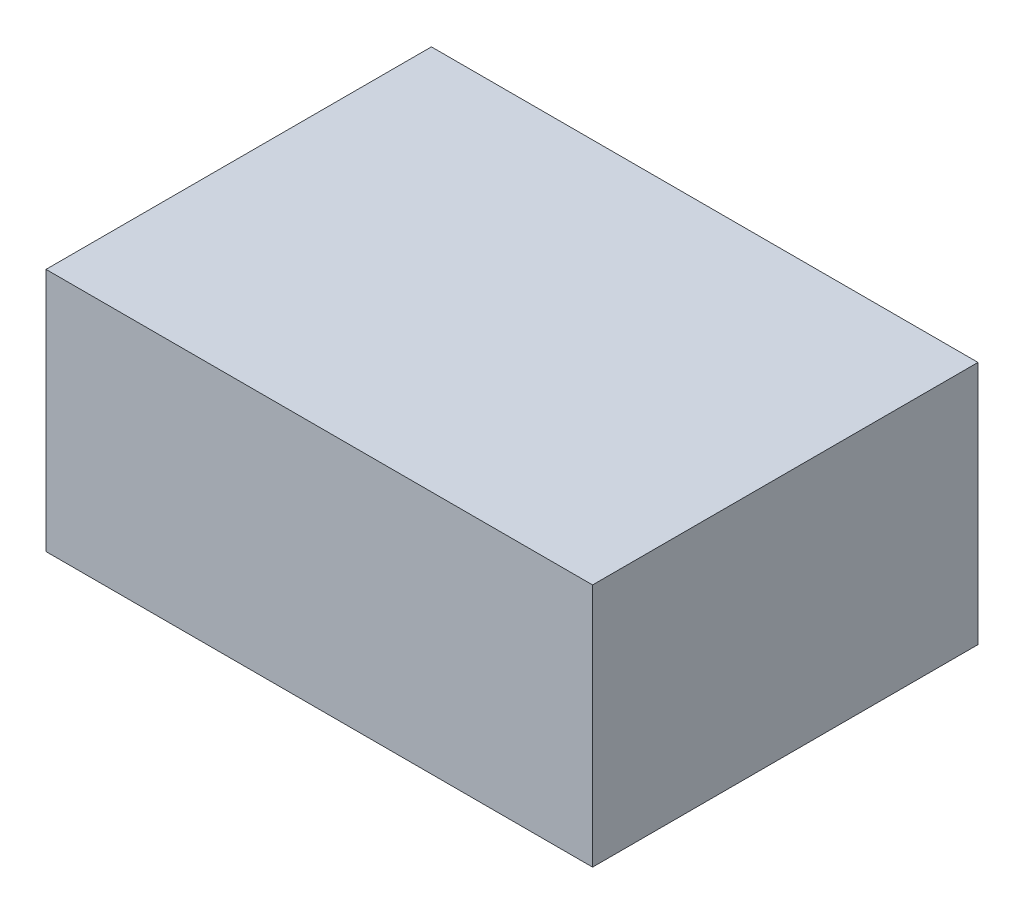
from build123d import *

# Parameters (mm, degrees)
SKETCH1_W      = 103.378
SKETCH1_H      = 72.898
EXTRUDE1_DEPTH = 46.228


with BuildPart() as part:
    # Sketch1 → Extrude1 (new body)
    with BuildSketch(Plane(origin=(0, 0, 0), x_dir=(1, 0, 0), z_dir=(0, 1, 0))):
        Rectangle(SKETCH1_W, SKETCH1_H)
    extrude(amount=EXTRUDE1_DEPTH)


solid = part.part
